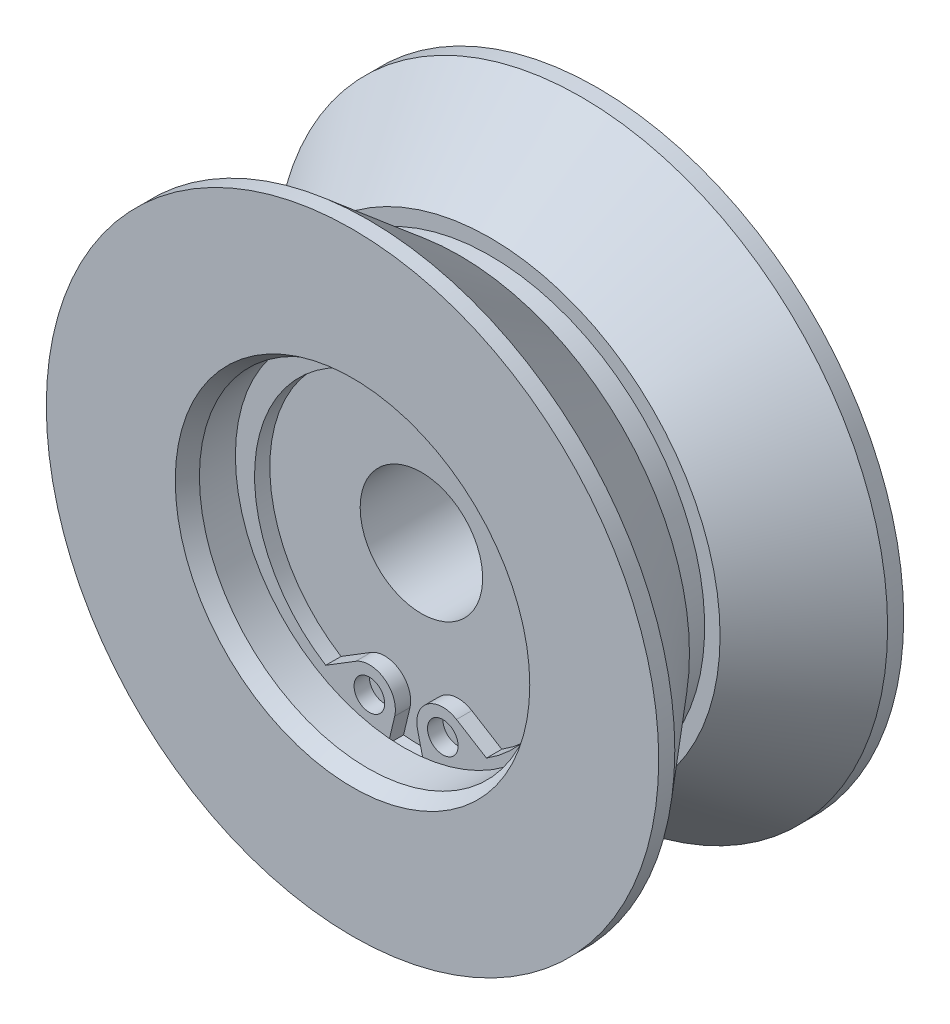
ISO-10303-21;
HEADER;
FILE_DESCRIPTION(('STEP AP214'),'2;1');
FILE_NAME('part.step','',(''),(''),'','','');
FILE_SCHEMA(('AUTOMOTIVE_DESIGN { 1 0 10303 214 1 1 1 1 }'));
ENDSEC;
DATA;
#1=APPLICATION_CONTEXT('core data for automotive mechanical design processes');
#2=APPLICATION_PROTOCOL_DEFINITION('international standard','automotive_design',2000,#1);
#3=PRODUCT_CONTEXT('',#1,'mechanical');
#4=PRODUCT('Part','Part','',(#3));
#5=PRODUCT_RELATED_PRODUCT_CATEGORY('part','',(#4));
#6=PRODUCT_DEFINITION_FORMATION('','',#4);
#7=PRODUCT_DEFINITION_CONTEXT('part definition',#1,'design');
#8=PRODUCT_DEFINITION('design','',#6,#7);
#9=PRODUCT_DEFINITION_SHAPE('','',#8);
#10=(LENGTH_UNIT() NAMED_UNIT(*) SI_UNIT(.MILLI.,.METRE.));
#11=(NAMED_UNIT(*) PLANE_ANGLE_UNIT() SI_UNIT($,.RADIAN.));
#12=(NAMED_UNIT(*) SI_UNIT($,.STERADIAN.) SOLID_ANGLE_UNIT());
#13=UNCERTAINTY_MEASURE_WITH_UNIT(LENGTH_MEASURE(1.E-05),#10,'distance_accuracy_value','');
#14=(GEOMETRIC_REPRESENTATION_CONTEXT(3) GLOBAL_UNCERTAINTY_ASSIGNED_CONTEXT((#13)) GLOBAL_UNIT_ASSIGNED_CONTEXT((#10,
#11,#12)) REPRESENTATION_CONTEXT('',''));
#15=CARTESIAN_POINT('',(0.,0.,0.));
#16=DIRECTION('',(0.,0.,1.));
#17=DIRECTION('',(1.,0.,0.));
#18=AXIS2_PLACEMENT_3D('',#15,#16,#17);
#19=CARTESIAN_POINT('',(0.,4.,3.5));
#20=DIRECTION('',(0.,0.,1.));
#21=DIRECTION('',(1.,0.,0.));
#22=AXIS2_PLACEMENT_3D('',#19,#20,#21);
#23=PLANE('',#22);
#24=CARTESIAN_POINT('',(2.4,-9.28614557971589,3.5));
#25=DIRECTION('',(0.,0.,1.));
#26=DIRECTION('',(1.,0.,0.));
#27=AXIS2_PLACEMENT_3D('',#24,#25,#26);
#28=CIRCLE('',#27,1.);
#29=CARTESIAN_POINT('',(3.4,-9.28614557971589,3.5));
#30=VERTEX_POINT('',#29);
#31=EDGE_CURVE('E324',#30,#30,#28,.T.);
#32=ORIENTED_EDGE('',*,*,#31,.T.);
#33=EDGE_LOOP('',(#32));
#34=FACE_BOUND('',#33,.T.);
#35=ADVANCED_FACE('F14',(#34),#23,.T.);
#36=CARTESIAN_POINT('',(-2.4,-9.28614557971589,3.5));
#37=DIRECTION('',(0.,0.,-1.));
#38=DIRECTION('',(1.,0.,0.));
#39=AXIS2_PLACEMENT_3D('',#36,#37,#38);
#40=CIRCLE('',#39,1.);
#41=CARTESIAN_POINT('',(-1.4,-9.28614557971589,3.5));
#42=VERTEX_POINT('',#41);
#43=EDGE_CURVE('E130',#42,#42,#40,.T.);
#44=ORIENTED_EDGE('',*,*,#43,.F.);
#45=EDGE_LOOP('',(#44));
#46=FACE_BOUND('',#45,.T.);
#47=ADVANCED_FACE('F209',(#46),#23,.T.);
#48=CARTESIAN_POINT('',(0.,0.,-8.));
#49=DIRECTION('',(0.,0.,-1.));
#50=DIRECTION('',(-1.,0.,0.));
#51=AXIS2_PLACEMENT_3D('',#48,#49,#50);
#52=CYLINDRICAL_SURFACE('',#51,14.);
#53=CARTESIAN_POINT('',(0.,0.,1.));
#54=DIRECTION('',(0.,0.,-1.));
#55=DIRECTION('',(-1.,0.,0.));
#56=AXIS2_PLACEMENT_3D('',#53,#54,#55);
#57=CIRCLE('',#56,14.);
#58=CARTESIAN_POINT('',(-14.,0.,1.));
#59=VERTEX_POINT('',#58);
#60=EDGE_CURVE('E151',#59,#59,#57,.T.);
#61=ORIENTED_EDGE('',*,*,#60,.T.);
#62=EDGE_LOOP('',(#61));
#63=FACE_BOUND('',#62,.T.);
#64=CARTESIAN_POINT('',(0.,0.,-1.));
#65=DIRECTION('',(0.,0.,-1.));
#66=DIRECTION('',(-1.,0.,0.));
#67=AXIS2_PLACEMENT_3D('',#64,#65,#66);
#68=CIRCLE('',#67,14.);
#69=CARTESIAN_POINT('',(-14.,0.,-1.));
#70=VERTEX_POINT('',#69);
#71=EDGE_CURVE('E148',#70,#70,#68,.T.);
#72=ORIENTED_EDGE('',*,*,#71,.F.);
#73=EDGE_LOOP('',(#72));
#74=FACE_BOUND('',#73,.T.);
#75=ADVANCED_FACE('F216',(#63,#74),#52,.T.);
#76=CARTESIAN_POINT('',(0.,15.0073571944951,1.));
#77=DIRECTION('',(0.,0.,-1.));
#78=DIRECTION('',(-1.,0.,0.));
#79=AXIS2_PLACEMENT_3D('',#76,#77,#78);
#80=PLANE('',#79);
#81=CARTESIAN_POINT('',(0.,0.,1.));
#82=DIRECTION('',(0.,0.,-1.));
#83=DIRECTION('',(-1.,0.,0.));
#84=AXIS2_PLACEMENT_3D('',#81,#82,#83);
#85=CIRCLE('',#84,15.0073571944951);
#86=CARTESIAN_POINT('',(-15.0073571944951,0.,1.));
#87=VERTEX_POINT('',#86);
#88=EDGE_CURVE('E154',#87,#87,#85,.T.);
#89=ORIENTED_EDGE('',*,*,#88,.T.);
#90=EDGE_LOOP('',(#89));
#91=FACE_BOUND('',#90,.T.);
#92=ORIENTED_EDGE('',*,*,#60,.F.);
#93=EDGE_LOOP('',(#92));
#94=FACE_BOUND('',#93,.T.);
#95=ADVANCED_FACE('F269',(#91,#94),#80,.T.);
#96=CARTESIAN_POINT('',(0.,15.0073571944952,-1.));
#97=DIRECTION('',(0.,0.,1.));
#98=DIRECTION('',(1.,0.,0.));
#99=AXIS2_PLACEMENT_3D('',#96,#97,#98);
#100=PLANE('',#99);
#101=ORIENTED_EDGE('',*,*,#71,.T.);
#102=EDGE_LOOP('',(#101));
#103=FACE_BOUND('',#102,.T.);
#104=CARTESIAN_POINT('',(0.,0.,-1.));
#105=DIRECTION('',(0.,0.,-1.));
#106=DIRECTION('',(-1.,0.,0.));
#107=AXIS2_PLACEMENT_3D('',#104,#105,#106);
#108=CIRCLE('',#107,15.0073571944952);
#109=CARTESIAN_POINT('',(-15.0073571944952,0.,-1.));
#110=VERTEX_POINT('',#109);
#111=EDGE_CURVE('E145',#110,#110,#108,.T.);
#112=ORIENTED_EDGE('',*,*,#111,.F.);
#113=EDGE_LOOP('',(#112));
#114=FACE_BOUND('',#113,.T.);
#115=ADVANCED_FACE('F266',(#103,#114),#100,.T.);
#116=CARTESIAN_POINT('',(0.,0.,1.));
#117=DIRECTION('',(0.,0.,1.));
#118=DIRECTION('',(1.,0.,0.));
#119=AXIS2_PLACEMENT_3D('',#116,#117,#118);
#120=CONICAL_SURFACE('',#119,15.0073571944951,0.698131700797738);
#121=CARTESIAN_POINT('',(0.,0.,6.95));
#122=DIRECTION('',(0.,0.,-1.));
#123=DIRECTION('',(-1.,0.,0.));
#124=AXIS2_PLACEMENT_3D('',#121,#122,#123);
#125=CIRCLE('',#124,20.);
#126=CARTESIAN_POINT('',(-20.,0.,6.95));
#127=VERTEX_POINT('',#126);
#128=EDGE_CURVE('E157',#127,#127,#125,.T.);
#129=ORIENTED_EDGE('',*,*,#128,.T.);
#130=EDGE_LOOP('',(#129));
#131=FACE_BOUND('',#130,.T.);
#132=ORIENTED_EDGE('',*,*,#88,.F.);
#133=EDGE_LOOP('',(#132));
#134=FACE_BOUND('',#133,.T.);
#135=ADVANCED_FACE('F264',(#131,#134),#120,.T.);
#136=CARTESIAN_POINT('',(0.,0.,-6.95));
#137=DIRECTION('',(0.,0.,-1.));
#138=DIRECTION('',(-1.,0.,0.));
#139=AXIS2_PLACEMENT_3D('',#136,#137,#138);
#140=CONICAL_SURFACE('',#139,20.,0.698131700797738);
#141=ORIENTED_EDGE('',*,*,#111,.T.);
#142=EDGE_LOOP('',(#141));
#143=FACE_BOUND('',#142,.T.);
#144=CARTESIAN_POINT('',(0.,0.,-6.95));
#145=DIRECTION('',(0.,0.,-1.));
#146=DIRECTION('',(-1.,0.,0.));
#147=AXIS2_PLACEMENT_3D('',#144,#145,#146);
#148=CIRCLE('',#147,20.);
#149=CARTESIAN_POINT('',(-20.,0.,-6.95));
#150=VERTEX_POINT('',#149);
#151=EDGE_CURVE('E142',#150,#150,#148,.T.);
#152=ORIENTED_EDGE('',*,*,#151,.F.);
#153=EDGE_LOOP('',(#152));
#154=FACE_BOUND('',#153,.T.);
#155=ADVANCED_FACE('F205',(#143,#154),#140,.T.);
#156=CARTESIAN_POINT('',(0.,0.,-8.));
#157=DIRECTION('',(0.,0.,-1.));
#158=DIRECTION('',(-1.,0.,0.));
#159=AXIS2_PLACEMENT_3D('',#156,#157,#158);
#160=CYLINDRICAL_SURFACE('',#159,20.);
#161=CARTESIAN_POINT('',(0.,0.,8.));
#162=DIRECTION('',(0.,0.,-1.));
#163=DIRECTION('',(-1.,0.,0.));
#164=AXIS2_PLACEMENT_3D('',#161,#162,#163);
#165=CIRCLE('',#164,20.);
#166=CARTESIAN_POINT('',(-20.,0.,8.));
#167=VERTEX_POINT('',#166);
#168=EDGE_CURVE('E160',#167,#167,#165,.T.);
#169=ORIENTED_EDGE('',*,*,#168,.T.);
#170=EDGE_LOOP('',(#169));
#171=FACE_BOUND('',#170,.T.);
#172=ORIENTED_EDGE('',*,*,#128,.F.);
#173=EDGE_LOOP('',(#172));
#174=FACE_BOUND('',#173,.T.);
#175=ADVANCED_FACE('F196',(#171,#174),#160,.T.);
#176=CARTESIAN_POINT('',(0.,0.,-8.));
#177=DIRECTION('',(0.,0.,-1.));
#178=DIRECTION('',(-1.,0.,0.));
#179=AXIS2_PLACEMENT_3D('',#176,#177,#178);
#180=CYLINDRICAL_SURFACE('',#179,20.);
#181=ORIENTED_EDGE('',*,*,#151,.T.);
#182=EDGE_LOOP('',(#181));
#183=FACE_BOUND('',#182,.T.);
#184=CARTESIAN_POINT('',(0.,0.,-8.));
#185=DIRECTION('',(0.,0.,-1.));
#186=DIRECTION('',(-1.,0.,0.));
#187=AXIS2_PLACEMENT_3D('',#184,#185,#186);
#188=CIRCLE('',#187,20.);
#189=CARTESIAN_POINT('',(-20.,0.,-8.));
#190=VERTEX_POINT('',#189);
#191=EDGE_CURVE('E131',#190,#190,#188,.T.);
#192=ORIENTED_EDGE('',*,*,#191,.F.);
#193=EDGE_LOOP('',(#192));
#194=FACE_BOUND('',#193,.T.);
#195=ADVANCED_FACE('F16',(#183,#194),#180,.T.);
#196=CARTESIAN_POINT('',(0.,20.,8.));
#197=DIRECTION('',(0.,0.,1.));
#198=DIRECTION('',(1.,0.,0.));
#199=AXIS2_PLACEMENT_3D('',#196,#197,#198);
#200=PLANE('',#199);
#201=CARTESIAN_POINT('',(0.,0.,8.));
#202=DIRECTION('',(0.,0.,-1.));
#203=DIRECTION('',(-1.,0.,0.));
#204=AXIS2_PLACEMENT_3D('',#201,#202,#203);
#205=CIRCLE('',#204,11.5773502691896);
#206=CARTESIAN_POINT('',(-11.5773502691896,0.,8.));
#207=VERTEX_POINT('',#206);
#208=EDGE_CURVE('E163',#207,#207,#205,.T.);
#209=ORIENTED_EDGE('',*,*,#208,.T.);
#210=EDGE_LOOP('',(#209));
#211=FACE_BOUND('',#210,.T.);
#212=ORIENTED_EDGE('',*,*,#168,.F.);
#213=EDGE_LOOP('',(#212));
#214=FACE_BOUND('',#213,.T.);
#215=ADVANCED_FACE('F195',(#211,#214),#200,.T.);
#216=CARTESIAN_POINT('',(0.,9.,-8.));
#217=DIRECTION('',(0.,0.,-1.));
#218=DIRECTION('',(-1.,0.,0.));
#219=AXIS2_PLACEMENT_3D('',#216,#217,#218);
#220=PLANE('',#219);
#221=ORIENTED_EDGE('',*,*,#191,.T.);
#222=EDGE_LOOP('',(#221));
#223=FACE_BOUND('',#222,.T.);
#224=CARTESIAN_POINT('',(0.,0.,-8.));
#225=DIRECTION('',(0.,0.,-1.));
#226=DIRECTION('',(-1.,0.,0.));
#227=AXIS2_PLACEMENT_3D('',#224,#225,#226);
#228=CIRCLE('',#227,9.);
#229=CARTESIAN_POINT('',(-9.,0.,-8.));
#230=VERTEX_POINT('',#229);
#231=EDGE_CURVE('E185',#230,#230,#228,.T.);
#232=ORIENTED_EDGE('',*,*,#231,.F.);
#233=EDGE_LOOP('',(#232));
#234=FACE_BOUND('',#233,.T.);
#235=ADVANCED_FACE('F191',(#223,#234),#220,.T.);
#236=CARTESIAN_POINT('',(0.,0.,8.));
#237=DIRECTION('',(0.,0.,1.));
#238=DIRECTION('',(1.,0.,0.));
#239=AXIS2_PLACEMENT_3D('',#236,#237,#238);
#240=CONICAL_SURFACE('',#239,11.5773502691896,0.523598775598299);
#241=CARTESIAN_POINT('',(0.,0.,7.));
#242=DIRECTION('',(0.,0.,-1.));
#243=DIRECTION('',(-1.,0.,0.));
#244=AXIS2_PLACEMENT_3D('',#241,#242,#243);
#245=CIRCLE('',#244,11.);
#246=CARTESIAN_POINT('',(-11.,0.,7.));
#247=VERTEX_POINT('',#246);
#248=EDGE_CURVE('E166',#247,#247,#245,.T.);
#249=ORIENTED_EDGE('',*,*,#248,.T.);
#250=EDGE_LOOP('',(#249));
#251=FACE_BOUND('',#250,.T.);
#252=ORIENTED_EDGE('',*,*,#208,.F.);
#253=EDGE_LOOP('',(#252));
#254=FACE_BOUND('',#253,.T.);
#255=ADVANCED_FACE('F280',(#251,#254),#240,.F.);
#256=CARTESIAN_POINT('',(0.,0.,-8.));
#257=DIRECTION('',(0.,0.,-1.));
#258=DIRECTION('',(-1.,0.,0.));
#259=AXIS2_PLACEMENT_3D('',#256,#257,#258);
#260=CYLINDRICAL_SURFACE('',#259,9.);
#261=ORIENTED_EDGE('',*,*,#231,.T.);
#262=EDGE_LOOP('',(#261));
#263=FACE_BOUND('',#262,.T.);
#264=CARTESIAN_POINT('',(0.,0.,-3.5));
#265=DIRECTION('',(0.,0.,-1.));
#266=DIRECTION('',(-1.,0.,0.));
#267=AXIS2_PLACEMENT_3D('',#264,#265,#266);
#268=CIRCLE('',#267,9.);
#269=CARTESIAN_POINT('',(-9.,0.,-3.5));
#270=VERTEX_POINT('',#269);
#271=EDGE_CURVE('E182',#270,#270,#268,.T.);
#272=ORIENTED_EDGE('',*,*,#271,.F.);
#273=EDGE_LOOP('',(#272));
#274=FACE_BOUND('',#273,.T.);
#275=ADVANCED_FACE('F283',(#263,#274),#260,.F.);
#276=CARTESIAN_POINT('',(0.,0.,-8.));
#277=DIRECTION('',(0.,0.,-1.));
#278=DIRECTION('',(-1.,0.,0.));
#279=AXIS2_PLACEMENT_3D('',#276,#277,#278);
#280=CYLINDRICAL_SURFACE('',#279,11.);
#281=CARTESIAN_POINT('',(0.,0.,4.65));
#282=DIRECTION('',(0.,0.,-1.));
#283=DIRECTION('',(-1.,0.,0.));
#284=AXIS2_PLACEMENT_3D('',#281,#282,#283);
#285=CIRCLE('',#284,11.);
#286=CARTESIAN_POINT('',(-11.,0.,4.65));
#287=VERTEX_POINT('',#286);
#288=EDGE_CURVE('E169',#287,#287,#285,.T.);
#289=ORIENTED_EDGE('',*,*,#288,.T.);
#290=EDGE_LOOP('',(#289));
#291=FACE_BOUND('',#290,.T.);
#292=ORIENTED_EDGE('',*,*,#248,.F.);
#293=EDGE_LOOP('',(#292));
#294=FACE_BOUND('',#293,.T.);
#295=ADVANCED_FACE('F285',(#291,#294),#280,.F.);
#296=CARTESIAN_POINT('',(0.,9.,-3.5));
#297=DIRECTION('',(0.,0.,-1.));
#298=DIRECTION('',(-1.,0.,0.));
#299=AXIS2_PLACEMENT_3D('',#296,#297,#298);
#300=PLANE('',#299);
#301=ORIENTED_EDGE('',*,*,#271,.T.);
#302=EDGE_LOOP('',(#301));
#303=FACE_BOUND('',#302,.T.);
#304=CARTESIAN_POINT('',(0.,0.,-3.5));
#305=DIRECTION('',(0.,0.,-1.));
#306=DIRECTION('',(-1.,0.,0.));
#307=AXIS2_PLACEMENT_3D('',#304,#305,#306);
#308=CIRCLE('',#307,4.);
#309=CARTESIAN_POINT('',(-4.,0.,-3.5));
#310=VERTEX_POINT('',#309);
#311=EDGE_CURVE('E179',#310,#310,#308,.T.);
#312=ORIENTED_EDGE('',*,*,#311,.F.);
#313=EDGE_LOOP('',(#312));
#314=FACE_BOUND('',#313,.T.);
#315=ADVANCED_FACE('F288',(#303,#314),#300,.T.);
#316=CARTESIAN_POINT('',(0.,11.5,4.65));
#317=DIRECTION('',(0.,0.,-1.));
#318=DIRECTION('',(-1.,0.,0.));
#319=AXIS2_PLACEMENT_3D('',#316,#317,#318);
#320=PLANE('',#319);
#321=CARTESIAN_POINT('',(0.,0.,4.65));
#322=DIRECTION('',(0.,0.,-1.));
#323=DIRECTION('',(-1.,0.,0.));
#324=AXIS2_PLACEMENT_3D('',#321,#322,#323);
#325=CIRCLE('',#324,11.5);
#326=CARTESIAN_POINT('',(-11.5,0.,4.65));
#327=VERTEX_POINT('',#326);
#328=EDGE_CURVE('E172',#327,#327,#325,.T.);
#329=ORIENTED_EDGE('',*,*,#328,.T.);
#330=EDGE_LOOP('',(#329));
#331=FACE_BOUND('',#330,.T.);
#332=ORIENTED_EDGE('',*,*,#288,.F.);
#333=EDGE_LOOP('',(#332));
#334=FACE_BOUND('',#333,.T.);
#335=ADVANCED_FACE('F290',(#331,#334),#320,.T.);
#336=CARTESIAN_POINT('',(0.,0.,-8.));
#337=DIRECTION('',(0.,0.,-1.));
#338=DIRECTION('',(-1.,0.,0.));
#339=AXIS2_PLACEMENT_3D('',#336,#337,#338);
#340=CYLINDRICAL_SURFACE('',#339,11.5);
#341=ORIENTED_EDGE('',*,*,#328,.F.);
#342=EDGE_LOOP('',(#341));
#343=FACE_BOUND('',#342,.T.);
#344=DIRECTION('',(0.,0.,-1.));
#345=VECTOR('',#344,1.);
#346=CARTESIAN_POINT('',(1.16498191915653,-11.440839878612,-8.));
#347=LINE('',#346,#345);
#348=CARTESIAN_POINT('',(1.16498191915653,-11.440839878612,3.5));
#349=VERTEX_POINT('',#348);
#350=CARTESIAN_POINT('',(1.16498191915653,-11.440839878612,4.5));
#351=VERTEX_POINT('',#350);
#352=EDGE_CURVE('E18',#349,#351,#347,.F.);
#353=ORIENTED_EDGE('',*,*,#352,.F.);
#354=CARTESIAN_POINT('',(0.,0.,3.5));
#355=DIRECTION('',(0.,0.,-1.));
#356=DIRECTION('',(-1.,0.,0.));
#357=AXIS2_PLACEMENT_3D('',#354,#355,#356);
#358=CIRCLE('',#357,11.5);
#359=CARTESIAN_POINT('',(-1.16498191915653,-11.440839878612,3.5));
#360=VERTEX_POINT('',#359);
#361=EDGE_CURVE('E107',#349,#360,#358,.T.);
#362=ORIENTED_EDGE('',*,*,#361,.T.);
#363=DIRECTION('',(0.,0.,-1.));
#364=VECTOR('',#363,1.);
#365=CARTESIAN_POINT('',(-1.16498191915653,-11.440839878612,-8.));
#366=LINE('',#365,#364);
#367=CARTESIAN_POINT('',(-1.16498191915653,-11.440839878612,4.5));
#368=VERTEX_POINT('',#367);
#369=EDGE_CURVE('E138',#368,#360,#366,.T.);
#370=ORIENTED_EDGE('',*,*,#369,.F.);
#371=CARTESIAN_POINT('',(0.,0.,4.5));
#372=DIRECTION('',(0.,0.,-1.));
#373=DIRECTION('',(-1.,0.,0.));
#374=AXIS2_PLACEMENT_3D('',#371,#372,#373);
#375=CIRCLE('',#374,11.5);
#376=EDGE_CURVE('E9',#351,#368,#375,.F.);
#377=ORIENTED_EDGE('',*,*,#376,.F.);
#378=EDGE_LOOP('',(#353,#362,#370,#377));
#379=FACE_BOUND('',#378,.T.);
#380=ADVANCED_FACE('F292',(#343,#379),#340,.F.);
#381=CARTESIAN_POINT('',(0.,0.,-8.));
#382=DIRECTION('',(0.,0.,-1.));
#383=DIRECTION('',(-1.,0.,0.));
#384=AXIS2_PLACEMENT_3D('',#381,#382,#383);
#385=CYLINDRICAL_SURFACE('',#384,4.);
#386=ORIENTED_EDGE('',*,*,#311,.T.);
#387=EDGE_LOOP('',(#386));
#388=FACE_BOUND('',#387,.T.);
#389=CARTESIAN_POINT('',(0.,0.,3.5));
#390=DIRECTION('',(0.,0.,-1.));
#391=DIRECTION('',(-1.,0.,0.));
#392=AXIS2_PLACEMENT_3D('',#389,#390,#391);
#393=CIRCLE('',#392,4.);
#394=CARTESIAN_POINT('',(-4.,0.,3.5));
#395=VERTEX_POINT('',#394);
#396=EDGE_CURVE('E176',#395,#395,#393,.T.);
#397=ORIENTED_EDGE('',*,*,#396,.F.);
#398=EDGE_LOOP('',(#397));
#399=FACE_BOUND('',#398,.T.);
#400=ADVANCED_FACE('F222',(#388,#399),#385,.F.);
#401=ORIENTED_EDGE('',*,*,#396,.T.);
#402=EDGE_LOOP('',(#401));
#403=FACE_BOUND('',#402,.T.);
#404=DIRECTION('',(0.231349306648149,-0.972870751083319,0.));
#405=VECTOR('',#404,1.);
#406=CARTESIAN_POINT('',(0.746119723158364,-9.67943940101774,3.5));
#407=LINE('',#406,#405);
#408=CARTESIAN_POINT('',(0.746119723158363,-9.67943940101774,3.5));
#409=VERTEX_POINT('',#408);
#410=EDGE_CURVE('E34',#409,#349,#407,.T.);
#411=ORIENTED_EDGE('',*,*,#410,.F.);
#412=CARTESIAN_POINT('',(2.4,-9.28614557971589,3.5));
#413=DIRECTION('',(0.,0.,1.));
#414=DIRECTION('',(1.,0.,0.));
#415=AXIS2_PLACEMENT_3D('',#412,#413,#414);
#416=CIRCLE('',#415,1.7);
#417=CARTESIAN_POINT('',(3.29136923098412,-7.83857489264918,3.5));
#418=VERTEX_POINT('',#417);
#419=EDGE_CURVE('E94',#418,#409,#416,.T.);
#420=ORIENTED_EDGE('',*,*,#419,.F.);
#421=DIRECTION('',(-0.851512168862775,0.524334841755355,0.));
#422=VECTOR('',#421,1.);
#423=CARTESIAN_POINT('',(3.29136923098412,-7.83857489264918,3.5));
#424=LINE('',#423,#422);
#425=CARTESIAN_POINT('',(5.2489218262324,-9.04397520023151,3.5));
#426=VERTEX_POINT('',#425);
#427=EDGE_CURVE('E136',#426,#418,#424,.T.);
#428=ORIENTED_EDGE('',*,*,#427,.F.);
#429=CARTESIAN_POINT('',(0.,-0.65,3.5));
#430=DIRECTION('',(0.,0.,-1.));
#431=DIRECTION('',(0.,-1.,0.));
#432=AXIS2_PLACEMENT_3D('',#429,#430,#431);
#433=CIRCLE('',#432,9.9);
#434=CARTESIAN_POINT('',(-5.24892182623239,-9.04397520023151,3.5));
#435=VERTEX_POINT('',#434);
#436=EDGE_CURVE('E328',#435,#426,#433,.T.);
#437=ORIENTED_EDGE('',*,*,#436,.F.);
#438=DIRECTION('',(-0.851512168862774,-0.524334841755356,0.));
#439=VECTOR('',#438,1.);
#440=CARTESIAN_POINT('',(-3.29136923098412,-7.83857489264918,3.5));
#441=LINE('',#440,#439);
#442=CARTESIAN_POINT('',(-3.29136923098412,-7.83857489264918,3.5));
#443=VERTEX_POINT('',#442);
#444=EDGE_CURVE('E141',#443,#435,#441,.T.);
#445=ORIENTED_EDGE('',*,*,#444,.F.);
#446=CARTESIAN_POINT('',(-2.4,-9.28614557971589,3.5));
#447=DIRECTION('',(0.,0.,1.));
#448=DIRECTION('',(-1.,0.,0.));
#449=AXIS2_PLACEMENT_3D('',#446,#447,#448);
#450=CIRCLE('',#449,1.7);
#451=CARTESIAN_POINT('',(-0.746119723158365,-9.67943940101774,3.5));
#452=VERTEX_POINT('',#451);
#453=EDGE_CURVE('E121',#452,#443,#450,.T.);
#454=ORIENTED_EDGE('',*,*,#453,.F.);
#455=DIRECTION('',(0.231349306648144,0.97287075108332,0.));
#456=VECTOR('',#455,1.);
#457=CARTESIAN_POINT('',(-0.746119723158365,-9.67943940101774,3.5));
#458=LINE('',#457,#456);
#459=EDGE_CURVE('E115',#360,#452,#458,.T.);
#460=ORIENTED_EDGE('',*,*,#459,.F.);
#461=ORIENTED_EDGE('',*,*,#361,.F.);
#462=EDGE_LOOP('',(#411,#420,#428,#437,#445,#454,#460,#461));
#463=FACE_BOUND('',#462,.T.);
#464=ADVANCED_FACE('F105',(#403,#463),#23,.T.);
#465=CARTESIAN_POINT('',(0.,-0.65,4.5));
#466=DIRECTION('',(0.,0.,1.));
#467=DIRECTION('',(-1.,0.,0.));
#468=AXIS2_PLACEMENT_3D('',#465,#466,#467);
#469=CYLINDRICAL_SURFACE('',#468,9.9);
#470=ORIENTED_EDGE('',*,*,#436,.T.);
#471=DIRECTION('',(0.,0.,-1.));
#472=VECTOR('',#471,1.);
#473=CARTESIAN_POINT('',(5.2489218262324,-9.04397520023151,4.5));
#474=LINE('',#473,#472);
#475=CARTESIAN_POINT('',(5.2489218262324,-9.04397520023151,4.5));
#476=VERTEX_POINT('',#475);
#477=EDGE_CURVE('E132',#476,#426,#474,.T.);
#478=ORIENTED_EDGE('',*,*,#477,.F.);
#479=CARTESIAN_POINT('',(0.,-0.65,4.5));
#480=DIRECTION('',(0.,0.,-1.));
#481=DIRECTION('',(0.,-1.,0.));
#482=AXIS2_PLACEMENT_3D('',#479,#480,#481);
#483=CIRCLE('',#482,9.9);
#484=CARTESIAN_POINT('',(-5.24892182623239,-9.04397520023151,4.5));
#485=VERTEX_POINT('',#484);
#486=EDGE_CURVE('E319',#485,#476,#483,.T.);
#487=ORIENTED_EDGE('',*,*,#486,.F.);
#488=DIRECTION('',(0.,0.,-1.));
#489=VECTOR('',#488,1.);
#490=CARTESIAN_POINT('',(-5.24892182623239,-9.04397520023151,4.5));
#491=LINE('',#490,#489);
#492=EDGE_CURVE('E125',#485,#435,#491,.T.);
#493=ORIENTED_EDGE('',*,*,#492,.T.);
#494=EDGE_LOOP('',(#470,#478,#487,#493));
#495=FACE_BOUND('',#494,.T.);
#496=ADVANCED_FACE('F212',(#495),#469,.F.);
#497=CARTESIAN_POINT('',(3.29136923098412,-7.83857489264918,4.5));
#498=DIRECTION('',(-0.524334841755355,-0.851512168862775,0.));
#499=DIRECTION('',(-0.851512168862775,0.524334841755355,0.));
#500=AXIS2_PLACEMENT_3D('',#497,#498,#499);
#501=PLANE('',#500);
#502=ORIENTED_EDGE('',*,*,#427,.T.);
#503=DIRECTION('',(0.,0.,-1.));
#504=VECTOR('',#503,1.);
#505=CARTESIAN_POINT('',(3.29136923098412,-7.83857489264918,4.5));
#506=LINE('',#505,#504);
#507=CARTESIAN_POINT('',(3.29136923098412,-7.83857489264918,4.5));
#508=VERTEX_POINT('',#507);
#509=EDGE_CURVE('E98',#508,#418,#506,.T.);
#510=ORIENTED_EDGE('',*,*,#509,.F.);
#511=DIRECTION('',(-0.851512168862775,0.524334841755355,0.));
#512=VECTOR('',#511,1.);
#513=CARTESIAN_POINT('',(3.29136923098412,-7.83857489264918,4.5));
#514=LINE('',#513,#512);
#515=EDGE_CURVE('E311',#476,#508,#514,.T.);
#516=ORIENTED_EDGE('',*,*,#515,.F.);
#517=ORIENTED_EDGE('',*,*,#477,.T.);
#518=EDGE_LOOP('',(#502,#510,#516,#517));
#519=FACE_BOUND('',#518,.T.);
#520=ADVANCED_FACE('F225',(#519),#501,.F.);
#521=CARTESIAN_POINT('',(2.4,-9.28614557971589,4.5));
#522=DIRECTION('',(0.,0.,1.));
#523=DIRECTION('',(-1.,0.,0.));
#524=AXIS2_PLACEMENT_3D('',#521,#522,#523);
#525=CYLINDRICAL_SURFACE('',#524,1.7);
#526=ORIENTED_EDGE('',*,*,#419,.T.);
#527=DIRECTION('',(0.,0.,-1.));
#528=VECTOR('',#527,1.);
#529=CARTESIAN_POINT('',(0.746119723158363,-9.67943940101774,4.5));
#530=LINE('',#529,#528);
#531=CARTESIAN_POINT('',(0.746119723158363,-9.67943940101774,4.5));
#532=VERTEX_POINT('',#531);
#533=EDGE_CURVE('E97',#532,#409,#530,.T.);
#534=ORIENTED_EDGE('',*,*,#533,.F.);
#535=CARTESIAN_POINT('',(2.4,-9.28614557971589,4.5));
#536=DIRECTION('',(0.,0.,1.));
#537=DIRECTION('',(1.,0.,0.));
#538=AXIS2_PLACEMENT_3D('',#535,#536,#537);
#539=CIRCLE('',#538,1.7);
#540=EDGE_CURVE('E304',#508,#532,#539,.T.);
#541=ORIENTED_EDGE('',*,*,#540,.F.);
#542=ORIENTED_EDGE('',*,*,#509,.T.);
#543=EDGE_LOOP('',(#526,#534,#541,#542));
#544=FACE_BOUND('',#543,.T.);
#545=ADVANCED_FACE('F95',(#544),#525,.T.);
#546=CARTESIAN_POINT('',(-0.746119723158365,-9.67943940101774,4.5));
#547=DIRECTION('',(-0.97287075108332,0.231349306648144,0.));
#548=DIRECTION('',(0.,0.,1.));
#549=AXIS2_PLACEMENT_3D('',#546,#547,#548);
#550=PLANE('',#549);
#551=DIRECTION('',(0.231349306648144,0.97287075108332,0.));
#552=VECTOR('',#551,1.);
#553=CARTESIAN_POINT('',(-0.746119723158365,-9.67943940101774,4.5));
#554=LINE('',#553,#552);
#555=CARTESIAN_POINT('',(-0.746119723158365,-9.67943940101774,4.5));
#556=VERTEX_POINT('',#555);
#557=EDGE_CURVE('E306',#368,#556,#554,.T.);
#558=ORIENTED_EDGE('',*,*,#557,.F.);
#559=ORIENTED_EDGE('',*,*,#369,.T.);
#560=ORIENTED_EDGE('',*,*,#459,.T.);
#561=DIRECTION('',(0.,0.,-1.));
#562=VECTOR('',#561,1.);
#563=CARTESIAN_POINT('',(-0.746119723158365,-9.67943940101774,4.5));
#564=LINE('',#563,#562);
#565=EDGE_CURVE('E348',#556,#452,#564,.T.);
#566=ORIENTED_EDGE('',*,*,#565,.F.);
#567=EDGE_LOOP('',(#558,#559,#560,#566));
#568=FACE_BOUND('',#567,.T.);
#569=ADVANCED_FACE('F250',(#568),#550,.F.);
#570=CARTESIAN_POINT('',(0.,-0.65,4.5));
#571=DIRECTION('',(0.,0.,-1.));
#572=DIRECTION('',(0.,-1.,0.));
#573=AXIS2_PLACEMENT_3D('',#570,#571,#572);
#574=PLANE('',#573);
#575=CARTESIAN_POINT('',(-2.4,-9.28614557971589,4.5));
#576=DIRECTION('',(0.,0.,-1.));
#577=DIRECTION('',(1.,0.,0.));
#578=AXIS2_PLACEMENT_3D('',#575,#576,#577);
#579=CIRCLE('',#578,1.);
#580=CARTESIAN_POINT('',(-1.4,-9.28614557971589,4.5));
#581=VERTEX_POINT('',#580);
#582=EDGE_CURVE('E102',#581,#581,#579,.T.);
#583=ORIENTED_EDGE('',*,*,#582,.T.);
#584=EDGE_LOOP('',(#583));
#585=FACE_BOUND('',#584,.T.);
#586=CARTESIAN_POINT('',(2.4,-9.28614557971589,4.5));
#587=DIRECTION('',(0.,0.,1.));
#588=DIRECTION('',(1.,0.,0.));
#589=AXIS2_PLACEMENT_3D('',#586,#587,#588);
#590=CIRCLE('',#589,1.);
#591=CARTESIAN_POINT('',(3.4,-9.28614557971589,4.5));
#592=VERTEX_POINT('',#591);
#593=EDGE_CURVE('E127',#592,#592,#590,.T.);
#594=ORIENTED_EDGE('',*,*,#593,.F.);
#595=EDGE_LOOP('',(#594));
#596=FACE_BOUND('',#595,.T.);
#597=DIRECTION('',(0.231349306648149,-0.972870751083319,0.));
#598=VECTOR('',#597,1.);
#599=CARTESIAN_POINT('',(0.746119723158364,-9.67943940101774,4.5));
#600=LINE('',#599,#598);
#601=EDGE_CURVE('E112',#532,#351,#600,.T.);
#602=ORIENTED_EDGE('',*,*,#601,.T.);
#603=ORIENTED_EDGE('',*,*,#376,.T.);
#604=ORIENTED_EDGE('',*,*,#557,.T.);
#605=CARTESIAN_POINT('',(-2.4,-9.28614557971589,4.5));
#606=DIRECTION('',(0.,0.,1.));
#607=DIRECTION('',(-1.,0.,0.));
#608=AXIS2_PLACEMENT_3D('',#605,#606,#607);
#609=CIRCLE('',#608,1.7);
#610=CARTESIAN_POINT('',(-3.29136923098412,-7.83857489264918,4.5));
#611=VERTEX_POINT('',#610);
#612=EDGE_CURVE('E314',#556,#611,#609,.T.);
#613=ORIENTED_EDGE('',*,*,#612,.T.);
#614=DIRECTION('',(-0.851512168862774,-0.524334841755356,0.));
#615=VECTOR('',#614,1.);
#616=CARTESIAN_POINT('',(-3.29136923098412,-7.83857489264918,4.5));
#617=LINE('',#616,#615);
#618=EDGE_CURVE('E137',#611,#485,#617,.T.);
#619=ORIENTED_EDGE('',*,*,#618,.T.);
#620=ORIENTED_EDGE('',*,*,#486,.T.);
#621=ORIENTED_EDGE('',*,*,#515,.T.);
#622=ORIENTED_EDGE('',*,*,#540,.T.);
#623=EDGE_LOOP('',(#602,#603,#604,#613,#619,#620,#621,#622));
#624=FACE_BOUND('',#623,.T.);
#625=ADVANCED_FACE('F242',(#585,#596,#624),#574,.F.);
#626=CARTESIAN_POINT('',(2.4,-9.28614557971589,4.5));
#627=DIRECTION('',(0.,0.,1.));
#628=DIRECTION('',(-1.,0.,0.));
#629=AXIS2_PLACEMENT_3D('',#626,#627,#628);
#630=CYLINDRICAL_SURFACE('',#629,1.);
#631=ORIENTED_EDGE('',*,*,#31,.F.);
#632=EDGE_LOOP('',(#631));
#633=FACE_BOUND('',#632,.T.);
#634=ORIENTED_EDGE('',*,*,#593,.T.);
#635=EDGE_LOOP('',(#634));
#636=FACE_BOUND('',#635,.T.);
#637=ADVANCED_FACE('F238',(#633,#636),#630,.F.);
#638=CARTESIAN_POINT('',(-2.4,-9.28614557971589,4.5));
#639=DIRECTION('',(0.,0.,1.));
#640=DIRECTION('',(-1.,0.,0.));
#641=AXIS2_PLACEMENT_3D('',#638,#639,#640);
#642=CYLINDRICAL_SURFACE('',#641,1.);
#643=ORIENTED_EDGE('',*,*,#43,.T.);
#644=EDGE_LOOP('',(#643));
#645=FACE_BOUND('',#644,.T.);
#646=ORIENTED_EDGE('',*,*,#582,.F.);
#647=EDGE_LOOP('',(#646));
#648=FACE_BOUND('',#647,.T.);
#649=ADVANCED_FACE('F234',(#645,#648),#642,.F.);
#650=CARTESIAN_POINT('',(-3.29136923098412,-7.83857489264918,4.5));
#651=DIRECTION('',(0.524334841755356,-0.851512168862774,0.));
#652=DIRECTION('',(0.,0.,-1.));
#653=AXIS2_PLACEMENT_3D('',#650,#651,#652);
#654=PLANE('',#653);
#655=ORIENTED_EDGE('',*,*,#444,.T.);
#656=ORIENTED_EDGE('',*,*,#492,.F.);
#657=ORIENTED_EDGE('',*,*,#618,.F.);
#658=DIRECTION('',(0.,0.,-1.));
#659=VECTOR('',#658,1.);
#660=CARTESIAN_POINT('',(-3.29136923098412,-7.83857489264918,4.5));
#661=LINE('',#660,#659);
#662=EDGE_CURVE('E321',#611,#443,#661,.T.);
#663=ORIENTED_EDGE('',*,*,#662,.T.);
#664=EDGE_LOOP('',(#655,#656,#657,#663));
#665=FACE_BOUND('',#664,.T.);
#666=ADVANCED_FACE('F237',(#665),#654,.F.);
#667=CARTESIAN_POINT('',(-2.4,-9.28614557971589,4.5));
#668=DIRECTION('',(0.,0.,1.));
#669=DIRECTION('',(-1.,0.,0.));
#670=AXIS2_PLACEMENT_3D('',#667,#668,#669);
#671=CYLINDRICAL_SURFACE('',#670,1.7);
#672=ORIENTED_EDGE('',*,*,#453,.T.);
#673=ORIENTED_EDGE('',*,*,#662,.F.);
#674=ORIENTED_EDGE('',*,*,#612,.F.);
#675=ORIENTED_EDGE('',*,*,#565,.T.);
#676=EDGE_LOOP('',(#672,#673,#674,#675));
#677=FACE_BOUND('',#676,.T.);
#678=ADVANCED_FACE('F244',(#677),#671,.T.);
#679=CARTESIAN_POINT('',(0.746119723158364,-9.67943940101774,4.5));
#680=DIRECTION('',(0.972870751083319,0.231349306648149,0.));
#681=DIRECTION('',(0.,0.,-1.));
#682=AXIS2_PLACEMENT_3D('',#679,#680,#681);
#683=PLANE('',#682);
#684=ORIENTED_EDGE('',*,*,#410,.T.);
#685=ORIENTED_EDGE('',*,*,#352,.T.);
#686=ORIENTED_EDGE('',*,*,#601,.F.);
#687=ORIENTED_EDGE('',*,*,#533,.T.);
#688=EDGE_LOOP('',(#684,#685,#686,#687));
#689=FACE_BOUND('',#688,.T.);
#690=ADVANCED_FACE('F110',(#689),#683,.F.);
#691=CLOSED_SHELL('',(#35,#47,#75,#95,#115,#135,#155,#175,#195,#215,#235,#255,#275,#295,#315,
#335,#380,#400,#464,#496,#520,#545,#569,#625,#637,#649,#666,#678,#690));
#692=MANIFOLD_SOLID_BREP('B1',#691);
#693=ADVANCED_BREP_SHAPE_REPRESENTATION('',(#18,#692),#14);
#694=SHAPE_DEFINITION_REPRESENTATION(#9,#693);
ENDSEC;
END-ISO-10303-21;
